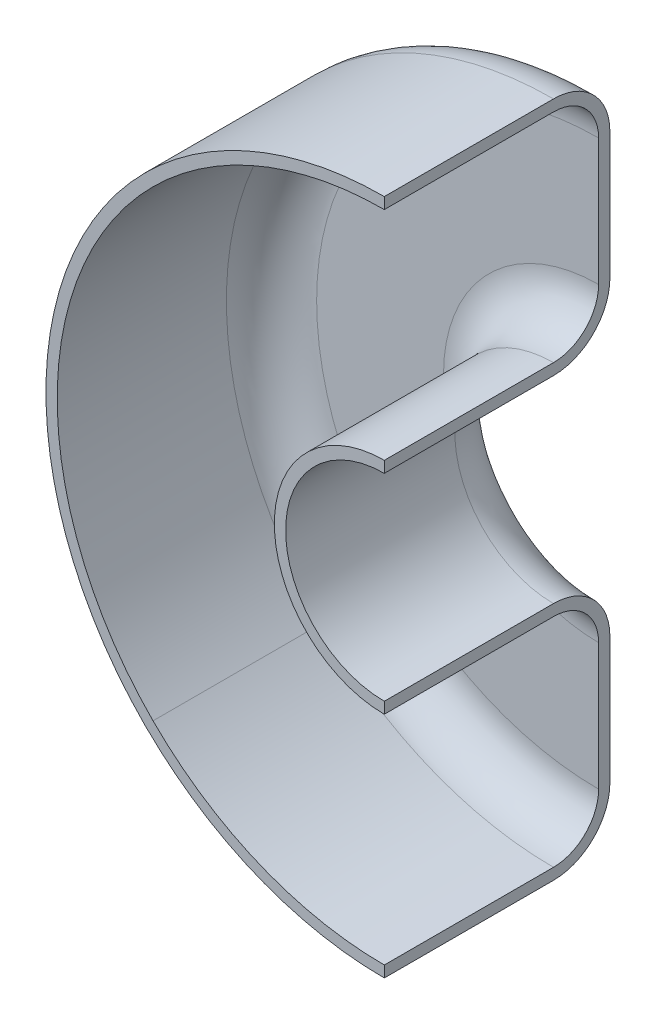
from build123d import *

# Parameters (mm, degrees)
SKETCH1_R           = 60
EXTRUDE1_DEPTH      = 40
SKETCH2_R           = 17.5
CUT_EXTRUDE1_DEPTH  = 94.808315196
FILLET1_R           = 10
SHELL1_T            = -2
SYMMETRY_DEPTH      = 94.808315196
SYMMETRY_DEPTH_BACK = 94.808315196


with BuildPart() as part:
    # Sketch1 → Extrude1 (new body)
    with BuildSketch(Plane.XY):
        Circle(SKETCH1_R)
    extrude(amount=EXTRUDE1_DEPTH)

    # Sketch2 → Cut-Extrude1 (cut, through all)
    with BuildSketch(Plane.XY.offset(40)):
        Circle(SKETCH2_R)
    extrude(amount=-CUT_EXTRUDE1_DEPTH, mode=Mode.SUBTRACT)

    # Fillet1
    fillet1_edges = [part.edges().sort_by_distance(p)[0] for p in [
        (-60, 0, 0),
        (-17.5, 0, 0),
    ]]
    fillet(fillet1_edges, radius=FILLET1_R)

    # Shell1
    shell1_openings = [part.faces().sort_by_distance(p)[0] for p in [
        (-58.302943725, 0, 40),
    ]]
    offset(amount=SHELL1_T, openings=shell1_openings, kind=Kind.INTERSECTION)

    # Sketch5 → symmetry (cut, two sides: drawn at the far end of the back side and taken through both)
    with BuildSketch(Plane(origin=(0, 0, 0), x_dir=(1, 0, 0), z_dir=(0, 1, 0)).offset(-SYMMETRY_DEPTH_BACK)):
        Polygon((0, 154.222051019), (0, 0), (0, -40), (0, -194.222051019), (308.444102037, -194.222051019), (308.444102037, 154.222051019), align=None)
    extrude(amount=SYMMETRY_DEPTH + SYMMETRY_DEPTH_BACK, mode=Mode.SUBTRACT)


solid = part.part
